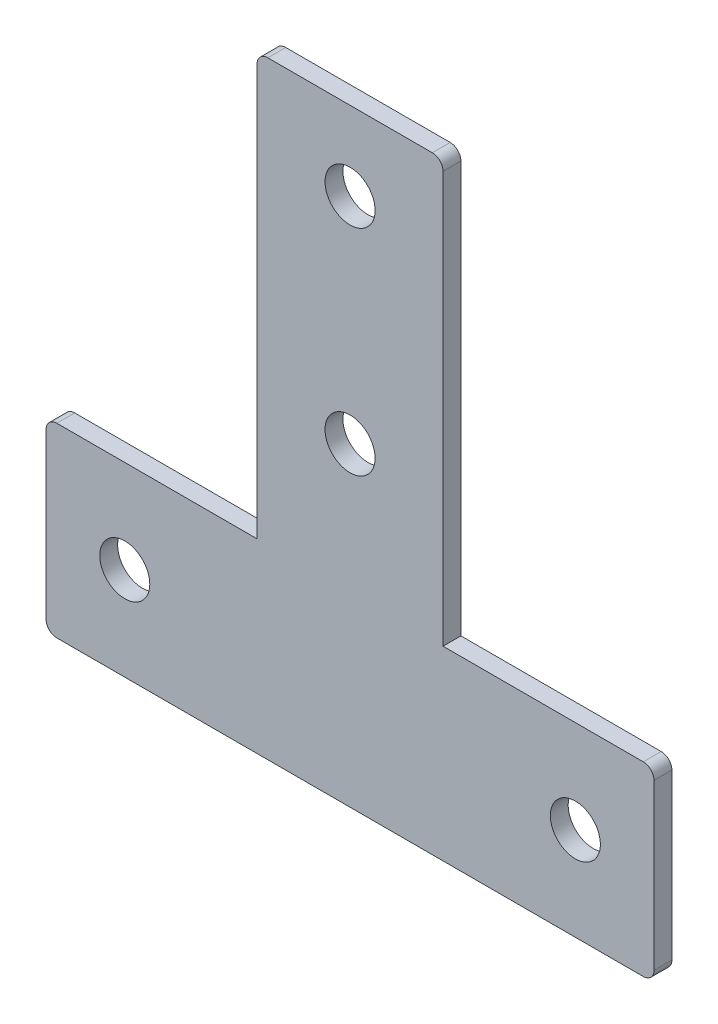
from build123d import *

# Parameters (mm, degrees)
SKETCH_1_R      = 3.5
EXTRUDE_2_DEPTH = 1.25
FILLET_1_R      = 1.5


with BuildPart() as part:
    # Sketch 1 → Extrude 2 (new, symmetric)
    with BuildSketch(Plane.XY):
        Polygon((-42.5, 0), (-42.5, 26), (-13, 26), (-13, 85), (13, 85), (13, 26), (42.5, 26), (42.5, 0), align=None)
        with Locations((0, 74)):
            Circle(SKETCH_1_R, mode=Mode.SUBTRACT)
        with Locations((0, 44)):
            Circle(SKETCH_1_R, mode=Mode.SUBTRACT)
        with Locations((-31.5, 13)):
            Circle(SKETCH_1_R, mode=Mode.SUBTRACT)
        with Locations((31.5, 13)):
            Circle(SKETCH_1_R, mode=Mode.SUBTRACT)
    extrude(amount=EXTRUDE_2_DEPTH, both=True)

    # Fillet 1
    fillet_1_edges = [part.edges().sort_by_distance(p)[0] for p in [
        (-42.5, 0, 0),
        (-42.5, 26, 0),
        (-13, 85, 0),
        (13, 85, 0),
        (42.5, 26, 0),
        (42.5, 0, 0),
    ]]
    fillet(fillet_1_edges, radius=FILLET_1_R)


solid = part.part
